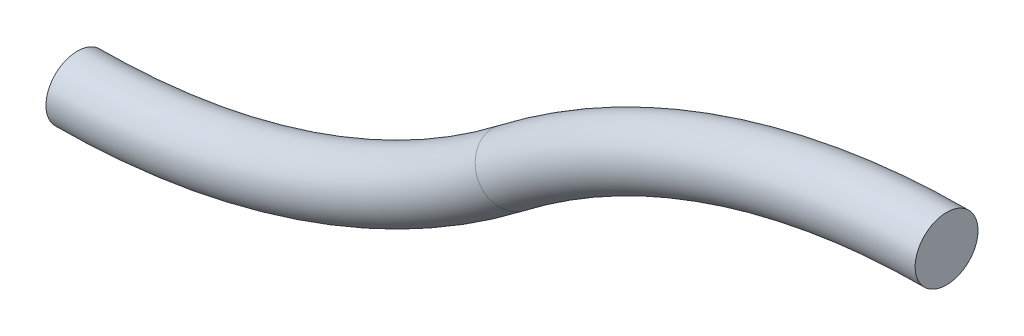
from build123d import *

# Parameters (mm, degrees)
SKETCH2_R = 3.96875


with BuildPart() as part:
    # Sweep1: sweep along a path in Sketch1
    with BuildLine(Plane.XY) as sweep1_path:
        ThreePointArc((0, 0), (28.96108, 4.779047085), (54.8513, 18.609446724))
        ThreePointArc((54.8513, 18.609446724), (80.74152, 32.439846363), (109.7026, 37.218893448))
    # Sketch2 → Sweep1 (sweep)
    with BuildSketch(Plane(origin=(0, 0, 0), x_dir=(0, 0, -1), z_dir=(1, 0, 0))):
        Circle(SKETCH2_R)
    sweep(path=sweep1_path.line)


solid = part.part
